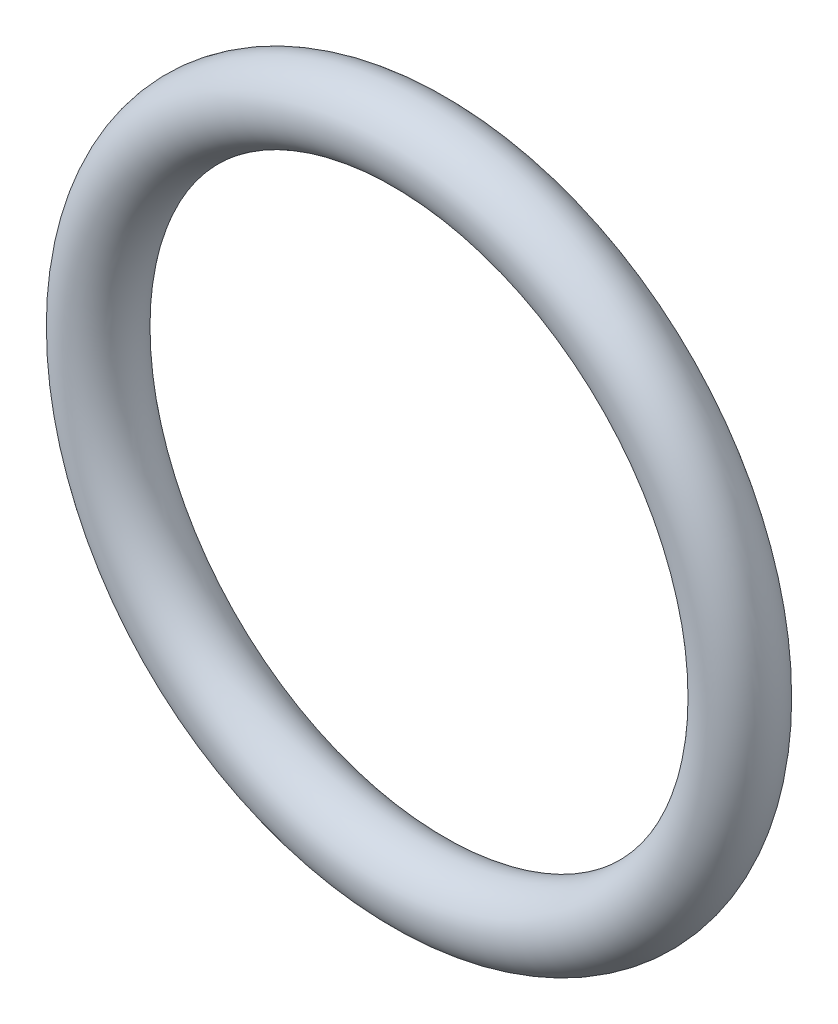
from build123d import *

# Parameters (mm, degrees)
ESQUISSE2_R = 1


with BuildPart() as part:
    # Esquisse2 → Base-R_volution (revolve)
    with BuildSketch(Plane.XZ):
        with Locations((8.75, 2.75)):
            Circle(ESQUISSE2_R)
    revolve(axis=Axis((0, 0, 1.916272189), (0, 0, -1)))


solid = part.part
